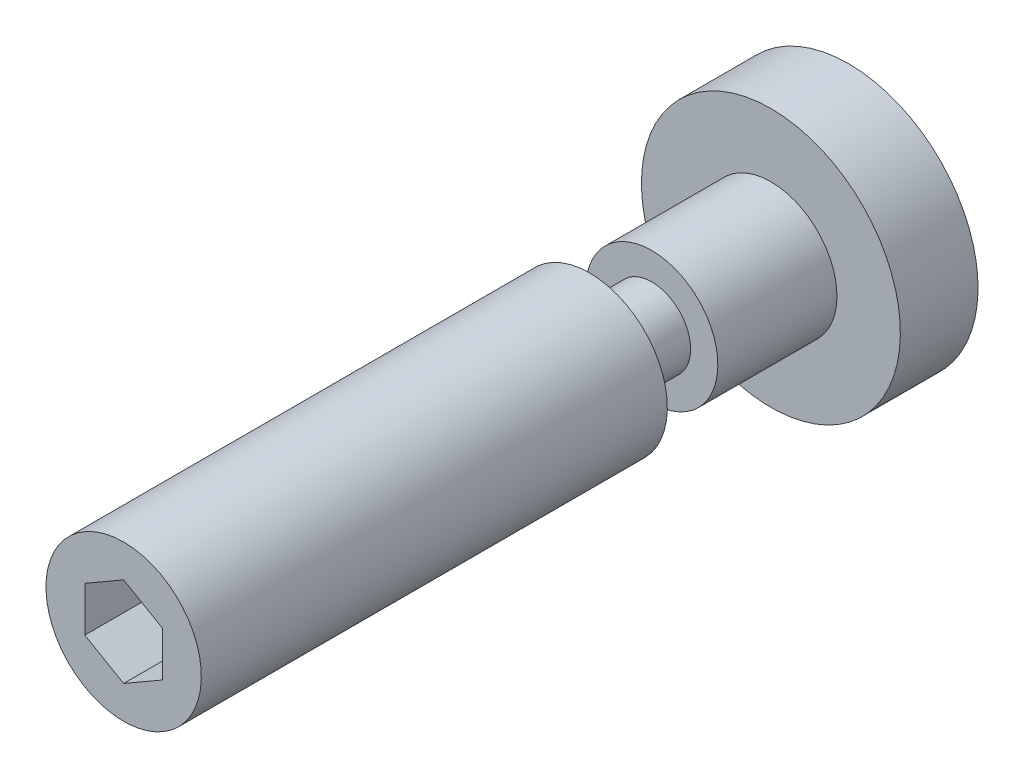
ISO-10303-21;
HEADER;
FILE_DESCRIPTION(('STEP AP214'),'2;1');
FILE_NAME('part.step','',(''),(''),'','','');
FILE_SCHEMA(('AUTOMOTIVE_DESIGN { 1 0 10303 214 1 1 1 1 }'));
ENDSEC;
DATA;
#1=APPLICATION_CONTEXT('core data for automotive mechanical design processes');
#2=APPLICATION_PROTOCOL_DEFINITION('international standard','automotive_design',2000,#1);
#3=PRODUCT_CONTEXT('',#1,'mechanical');
#4=PRODUCT('Part','Part','',(#3));
#5=PRODUCT_RELATED_PRODUCT_CATEGORY('part','',(#4));
#6=PRODUCT_DEFINITION_FORMATION('','',#4);
#7=PRODUCT_DEFINITION_CONTEXT('part definition',#1,'design');
#8=PRODUCT_DEFINITION('design','',#6,#7);
#9=PRODUCT_DEFINITION_SHAPE('','',#8);
#10=(LENGTH_UNIT() NAMED_UNIT(*) SI_UNIT(.MILLI.,.METRE.));
#11=(NAMED_UNIT(*) PLANE_ANGLE_UNIT() SI_UNIT($,.RADIAN.));
#12=(NAMED_UNIT(*) SI_UNIT($,.STERADIAN.) SOLID_ANGLE_UNIT());
#13=UNCERTAINTY_MEASURE_WITH_UNIT(LENGTH_MEASURE(1.E-05),#10,'distance_accuracy_value','');
#14=(GEOMETRIC_REPRESENTATION_CONTEXT(3) GLOBAL_UNCERTAINTY_ASSIGNED_CONTEXT((#13)) GLOBAL_UNIT_ASSIGNED_CONTEXT((#10,
#11,#12)) REPRESENTATION_CONTEXT('',''));
#15=CARTESIAN_POINT('',(0.,0.,0.));
#16=DIRECTION('',(0.,0.,1.));
#17=DIRECTION('',(1.,0.,0.));
#18=AXIS2_PLACEMENT_3D('',#15,#16,#17);
#19=CARTESIAN_POINT('',(0.,0.,0.));
#20=DIRECTION('',(0.,0.,1.));
#21=DIRECTION('',(0.,1.,0.));
#22=AXIS2_PLACEMENT_3D('',#19,#20,#21);
#23=PLANE('',#22);
#24=CARTESIAN_POINT('',(0.,0.,0.));
#25=DIRECTION('',(0.,0.,1.));
#26=DIRECTION('',(0.,1.,0.));
#27=AXIS2_PLACEMENT_3D('',#24,#25,#26);
#28=CIRCLE('',#27,5.);
#29=CARTESIAN_POINT('',(0.,5.,0.));
#30=VERTEX_POINT('',#29);
#31=EDGE_CURVE('E9',#30,#30,#28,.T.);
#32=ORIENTED_EDGE('',*,*,#31,.F.);
#33=EDGE_LOOP('',(#32));
#34=FACE_BOUND('',#33,.T.);
#35=ADVANCED_FACE('F14',(#34),#23,.F.);
#36=CARTESIAN_POINT('',(0.,0.,40.));
#37=DIRECTION('',(0.,0.,1.));
#38=DIRECTION('',(0.,1.,0.));
#39=AXIS2_PLACEMENT_3D('',#36,#37,#38);
#40=CYLINDRICAL_SURFACE('',#39,5.);
#41=CARTESIAN_POINT('',(0.,0.,3.));
#42=DIRECTION('',(0.,0.,1.));
#43=DIRECTION('',(0.,1.,0.));
#44=AXIS2_PLACEMENT_3D('',#41,#42,#43);
#45=CIRCLE('',#44,5.);
#46=CARTESIAN_POINT('',(0.,5.,3.));
#47=VERTEX_POINT('',#46);
#48=EDGE_CURVE('E21',#47,#47,#45,.T.);
#49=ORIENTED_EDGE('',*,*,#48,.F.);
#50=EDGE_LOOP('',(#49));
#51=FACE_BOUND('',#50,.T.);
#52=ORIENTED_EDGE('',*,*,#31,.T.);
#53=EDGE_LOOP('',(#52));
#54=FACE_BOUND('',#53,.T.);
#55=ADVANCED_FACE('F142',(#51,#54),#40,.T.);
#56=CARTESIAN_POINT('',(0.,-5.,3.));
#57=DIRECTION('',(0.,0.,-1.));
#58=DIRECTION('',(0.,-1.,0.));
#59=AXIS2_PLACEMENT_3D('',#56,#57,#58);
#60=PLANE('',#59);
#61=CARTESIAN_POINT('',(0.,0.,3.));
#62=DIRECTION('',(0.,0.,1.));
#63=DIRECTION('',(0.,1.,0.));
#64=AXIS2_PLACEMENT_3D('',#61,#62,#63);
#65=CIRCLE('',#64,2.55);
#66=CARTESIAN_POINT('',(0.,2.55,3.));
#67=VERTEX_POINT('',#66);
#68=EDGE_CURVE('E135',#67,#67,#65,.T.);
#69=ORIENTED_EDGE('',*,*,#68,.F.);
#70=EDGE_LOOP('',(#69));
#71=FACE_BOUND('',#70,.T.);
#72=ORIENTED_EDGE('',*,*,#48,.T.);
#73=EDGE_LOOP('',(#72));
#74=FACE_BOUND('',#73,.T.);
#75=ADVANCED_FACE('F140',(#71,#74),#60,.F.);
#76=CARTESIAN_POINT('',(0.,0.,40.));
#77=DIRECTION('',(0.,0.,1.));
#78=DIRECTION('',(0.,1.,0.));
#79=AXIS2_PLACEMENT_3D('',#76,#77,#78);
#80=CYLINDRICAL_SURFACE('',#79,2.55);
#81=CARTESIAN_POINT('',(0.,0.,7.6));
#82=DIRECTION('',(0.,0.,1.));
#83=DIRECTION('',(0.,1.,0.));
#84=AXIS2_PLACEMENT_3D('',#81,#82,#83);
#85=CIRCLE('',#84,2.55);
#86=CARTESIAN_POINT('',(0.,2.55,7.6));
#87=VERTEX_POINT('',#86);
#88=EDGE_CURVE('E132',#87,#87,#85,.T.);
#89=ORIENTED_EDGE('',*,*,#88,.F.);
#90=EDGE_LOOP('',(#89));
#91=FACE_BOUND('',#90,.T.);
#92=ORIENTED_EDGE('',*,*,#68,.T.);
#93=EDGE_LOOP('',(#92));
#94=FACE_BOUND('',#93,.T.);
#95=ADVANCED_FACE('F165',(#91,#94),#80,.T.);
#96=CARTESIAN_POINT('',(0.,-2.55,7.6));
#97=DIRECTION('',(0.,0.,-1.));
#98=DIRECTION('',(0.,-1.,0.));
#99=AXIS2_PLACEMENT_3D('',#96,#97,#98);
#100=PLANE('',#99);
#101=CARTESIAN_POINT('',(0.,0.,7.6));
#102=DIRECTION('',(0.,0.,1.));
#103=DIRECTION('',(0.,1.,0.));
#104=AXIS2_PLACEMENT_3D('',#101,#102,#103);
#105=CIRCLE('',#104,1.5);
#106=CARTESIAN_POINT('',(0.,1.5,7.6));
#107=VERTEX_POINT('',#106);
#108=EDGE_CURVE('E129',#107,#107,#105,.T.);
#109=ORIENTED_EDGE('',*,*,#108,.F.);
#110=EDGE_LOOP('',(#109));
#111=FACE_BOUND('',#110,.T.);
#112=ORIENTED_EDGE('',*,*,#88,.T.);
#113=EDGE_LOOP('',(#112));
#114=FACE_BOUND('',#113,.T.);
#115=ADVANCED_FACE('F174',(#111,#114),#100,.F.);
#116=CARTESIAN_POINT('',(0.,0.,40.));
#117=DIRECTION('',(0.,0.,1.));
#118=DIRECTION('',(0.,1.,0.));
#119=AXIS2_PLACEMENT_3D('',#116,#117,#118);
#120=CYLINDRICAL_SURFACE('',#119,1.5);
#121=CARTESIAN_POINT('',(0.,0.,10.));
#122=DIRECTION('',(0.,0.,1.));
#123=DIRECTION('',(0.,1.,0.));
#124=AXIS2_PLACEMENT_3D('',#121,#122,#123);
#125=CIRCLE('',#124,1.5);
#126=CARTESIAN_POINT('',(0.,1.5,10.));
#127=VERTEX_POINT('',#126);
#128=EDGE_CURVE('E126',#127,#127,#125,.T.);
#129=ORIENTED_EDGE('',*,*,#128,.F.);
#130=EDGE_LOOP('',(#129));
#131=FACE_BOUND('',#130,.T.);
#132=ORIENTED_EDGE('',*,*,#108,.T.);
#133=EDGE_LOOP('',(#132));
#134=FACE_BOUND('',#133,.T.);
#135=ADVANCED_FACE('F183',(#131,#134),#120,.T.);
#136=CARTESIAN_POINT('',(0.,-1.5,10.));
#137=DIRECTION('',(0.,0.,1.));
#138=DIRECTION('',(0.,1.,0.));
#139=AXIS2_PLACEMENT_3D('',#136,#137,#138);
#140=PLANE('',#139);
#141=CARTESIAN_POINT('',(0.,0.,10.));
#142=DIRECTION('',(0.,0.,1.));
#143=DIRECTION('',(0.,1.,0.));
#144=AXIS2_PLACEMENT_3D('',#141,#142,#143);
#145=CIRCLE('',#144,3.);
#146=CARTESIAN_POINT('',(0.,3.,10.));
#147=VERTEX_POINT('',#146);
#148=EDGE_CURVE('E123',#147,#147,#145,.T.);
#149=ORIENTED_EDGE('',*,*,#148,.F.);
#150=EDGE_LOOP('',(#149));
#151=FACE_BOUND('',#150,.T.);
#152=ORIENTED_EDGE('',*,*,#128,.T.);
#153=EDGE_LOOP('',(#152));
#154=FACE_BOUND('',#153,.T.);
#155=ADVANCED_FACE('F192',(#151,#154),#140,.F.);
#156=CARTESIAN_POINT('',(0.,0.,40.));
#157=DIRECTION('',(0.,0.,1.));
#158=DIRECTION('',(0.,1.,0.));
#159=AXIS2_PLACEMENT_3D('',#156,#157,#158);
#160=CYLINDRICAL_SURFACE('',#159,3.);
#161=CARTESIAN_POINT('',(0.,0.,28.));
#162=DIRECTION('',(0.,0.,1.));
#163=DIRECTION('',(0.,1.,0.));
#164=AXIS2_PLACEMENT_3D('',#161,#162,#163);
#165=CIRCLE('',#164,3.);
#166=CARTESIAN_POINT('',(0.,3.,28.));
#167=VERTEX_POINT('',#166);
#168=EDGE_CURVE('E115',#167,#167,#165,.T.);
#169=ORIENTED_EDGE('',*,*,#168,.F.);
#170=EDGE_LOOP('',(#169));
#171=FACE_BOUND('',#170,.T.);
#172=ORIENTED_EDGE('',*,*,#148,.T.);
#173=EDGE_LOOP('',(#172));
#174=FACE_BOUND('',#173,.T.);
#175=ADVANCED_FACE('F201',(#171,#174),#160,.T.);
#176=CARTESIAN_POINT('',(0.,-3.,28.));
#177=DIRECTION('',(0.,0.,-1.));
#178=DIRECTION('',(0.,-1.,0.));
#179=AXIS2_PLACEMENT_3D('',#176,#177,#178);
#180=PLANE('',#179);
#181=DIRECTION('',(-0.866025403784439,-0.5,0.));
#182=VECTOR('',#181,1.);
#183=CARTESIAN_POINT('',(0.,1.73205080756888,28.));
#184=LINE('',#183,#182);
#185=CARTESIAN_POINT('',(0.,1.73205080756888,28.));
#186=VERTEX_POINT('',#185);
#187=CARTESIAN_POINT('',(-1.5,0.866025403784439,28.));
#188=VERTEX_POINT('',#187);
#189=EDGE_CURVE('E102',#186,#188,#184,.T.);
#190=ORIENTED_EDGE('',*,*,#189,.F.);
#191=DIRECTION('',(-0.866025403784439,0.5,0.));
#192=VECTOR('',#191,1.);
#193=CARTESIAN_POINT('',(1.5,0.866025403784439,28.));
#194=LINE('',#193,#192);
#195=CARTESIAN_POINT('',(1.5,0.866025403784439,28.));
#196=VERTEX_POINT('',#195);
#197=EDGE_CURVE('E28',#196,#186,#194,.T.);
#198=ORIENTED_EDGE('',*,*,#197,.F.);
#199=DIRECTION('',(0.,1.,0.));
#200=VECTOR('',#199,1.);
#201=CARTESIAN_POINT('',(1.5,-0.866025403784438,28.));
#202=LINE('',#201,#200);
#203=CARTESIAN_POINT('',(1.5,-0.866025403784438,28.));
#204=VERTEX_POINT('',#203);
#205=EDGE_CURVE('E111',#204,#196,#202,.T.);
#206=ORIENTED_EDGE('',*,*,#205,.F.);
#207=DIRECTION('',(0.866025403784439,0.5,0.));
#208=VECTOR('',#207,1.);
#209=CARTESIAN_POINT('',(0.,-1.73205080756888,28.));
#210=LINE('',#209,#208);
#211=CARTESIAN_POINT('',(0.,-1.73205080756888,28.));
#212=VERTEX_POINT('',#211);
#213=EDGE_CURVE('E109',#212,#204,#210,.T.);
#214=ORIENTED_EDGE('',*,*,#213,.F.);
#215=DIRECTION('',(0.866025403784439,-0.5,0.));
#216=VECTOR('',#215,1.);
#217=CARTESIAN_POINT('',(-1.5,-0.866025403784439,28.));
#218=LINE('',#217,#216);
#219=CARTESIAN_POINT('',(-1.5,-0.866025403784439,28.));
#220=VERTEX_POINT('',#219);
#221=EDGE_CURVE('E76',#220,#212,#218,.T.);
#222=ORIENTED_EDGE('',*,*,#221,.F.);
#223=DIRECTION('',(0.,-1.,0.));
#224=VECTOR('',#223,1.);
#225=CARTESIAN_POINT('',(-1.5,0.866025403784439,28.));
#226=LINE('',#225,#224);
#227=EDGE_CURVE('E105',#188,#220,#226,.T.);
#228=ORIENTED_EDGE('',*,*,#227,.F.);
#229=EDGE_LOOP('',(#190,#198,#206,#214,#222,#228));
#230=FACE_BOUND('',#229,.T.);
#231=ORIENTED_EDGE('',*,*,#168,.T.);
#232=EDGE_LOOP('',(#231));
#233=FACE_BOUND('',#232,.T.);
#234=ADVANCED_FACE('F210',(#230,#233),#180,.F.);
#235=CARTESIAN_POINT('',(1.5,0.866025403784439,24.));
#236=DIRECTION('',(0.5,0.866025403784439,0.));
#237=DIRECTION('',(-0.866025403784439,0.5,0.));
#238=AXIS2_PLACEMENT_3D('',#235,#236,#237);
#239=PLANE('',#238);
#240=ORIENTED_EDGE('',*,*,#197,.T.);
#241=DIRECTION('',(0.,0.,1.));
#242=VECTOR('',#241,1.);
#243=CARTESIAN_POINT('',(0.,1.73205080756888,24.));
#244=LINE('',#243,#242);
#245=CARTESIAN_POINT('',(0.,1.73205080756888,24.));
#246=VERTEX_POINT('',#245);
#247=EDGE_CURVE('E58',#246,#186,#244,.T.);
#248=ORIENTED_EDGE('',*,*,#247,.F.);
#249=DIRECTION('',(-0.866025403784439,0.5,0.));
#250=VECTOR('',#249,1.);
#251=CARTESIAN_POINT('',(1.5,0.866025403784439,24.));
#252=LINE('',#251,#250);
#253=CARTESIAN_POINT('',(1.5,0.866025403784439,24.));
#254=VERTEX_POINT('',#253);
#255=EDGE_CURVE('E113',#254,#246,#252,.T.);
#256=ORIENTED_EDGE('',*,*,#255,.F.);
#257=DIRECTION('',(0.,0.,1.));
#258=VECTOR('',#257,1.);
#259=CARTESIAN_POINT('',(1.5,0.866025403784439,24.));
#260=LINE('',#259,#258);
#261=EDGE_CURVE('E36',#254,#196,#260,.T.);
#262=ORIENTED_EDGE('',*,*,#261,.T.);
#263=EDGE_LOOP('',(#240,#248,#256,#262));
#264=FACE_BOUND('',#263,.T.);
#265=ADVANCED_FACE('F219',(#264),#239,.F.);
#266=CARTESIAN_POINT('',(1.5,-0.866025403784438,24.));
#267=DIRECTION('',(1.,0.,0.));
#268=DIRECTION('',(0.,0.,-1.));
#269=AXIS2_PLACEMENT_3D('',#266,#267,#268);
#270=PLANE('',#269);
#271=ORIENTED_EDGE('',*,*,#205,.T.);
#272=ORIENTED_EDGE('',*,*,#261,.F.);
#273=DIRECTION('',(0.,1.,0.));
#274=VECTOR('',#273,1.);
#275=CARTESIAN_POINT('',(1.5,-0.866025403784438,24.));
#276=LINE('',#275,#274);
#277=CARTESIAN_POINT('',(1.5,-0.866025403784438,24.));
#278=VERTEX_POINT('',#277);
#279=EDGE_CURVE('E88',#278,#254,#276,.T.);
#280=ORIENTED_EDGE('',*,*,#279,.F.);
#281=DIRECTION('',(0.,0.,1.));
#282=VECTOR('',#281,1.);
#283=CARTESIAN_POINT('',(1.5,-0.866025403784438,24.));
#284=LINE('',#283,#282);
#285=EDGE_CURVE('E80',#278,#204,#284,.T.);
#286=ORIENTED_EDGE('',*,*,#285,.T.);
#287=EDGE_LOOP('',(#271,#272,#280,#286));
#288=FACE_BOUND('',#287,.T.);
#289=ADVANCED_FACE('F228',(#288),#270,.F.);
#290=CARTESIAN_POINT('',(0.,-1.73205080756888,24.));
#291=DIRECTION('',(0.5,-0.866025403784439,0.));
#292=DIRECTION('',(0.866025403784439,0.5,0.));
#293=AXIS2_PLACEMENT_3D('',#290,#291,#292);
#294=PLANE('',#293);
#295=ORIENTED_EDGE('',*,*,#213,.T.);
#296=ORIENTED_EDGE('',*,*,#285,.F.);
#297=DIRECTION('',(0.866025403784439,0.5,0.));
#298=VECTOR('',#297,1.);
#299=CARTESIAN_POINT('',(0.,-1.73205080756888,24.));
#300=LINE('',#299,#298);
#301=CARTESIAN_POINT('',(0.,-1.73205080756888,24.));
#302=VERTEX_POINT('',#301);
#303=EDGE_CURVE('E84',#302,#278,#300,.T.);
#304=ORIENTED_EDGE('',*,*,#303,.F.);
#305=DIRECTION('',(0.,0.,1.));
#306=VECTOR('',#305,1.);
#307=CARTESIAN_POINT('',(0.,-1.73205080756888,24.));
#308=LINE('',#307,#306);
#309=EDGE_CURVE('E69',#302,#212,#308,.T.);
#310=ORIENTED_EDGE('',*,*,#309,.T.);
#311=EDGE_LOOP('',(#295,#296,#304,#310));
#312=FACE_BOUND('',#311,.T.);
#313=ADVANCED_FACE('F85',(#312),#294,.F.);
#314=CARTESIAN_POINT('',(-1.5,-0.866025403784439,24.));
#315=DIRECTION('',(-0.5,-0.866025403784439,0.));
#316=DIRECTION('',(0.866025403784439,-0.5,0.));
#317=AXIS2_PLACEMENT_3D('',#314,#315,#316);
#318=PLANE('',#317);
#319=ORIENTED_EDGE('',*,*,#221,.T.);
#320=ORIENTED_EDGE('',*,*,#309,.F.);
#321=DIRECTION('',(0.866025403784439,-0.5,0.));
#322=VECTOR('',#321,1.);
#323=CARTESIAN_POINT('',(-1.5,-0.866025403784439,24.));
#324=LINE('',#323,#322);
#325=CARTESIAN_POINT('',(-1.5,-0.866025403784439,24.));
#326=VERTEX_POINT('',#325);
#327=EDGE_CURVE('E73',#326,#302,#324,.T.);
#328=ORIENTED_EDGE('',*,*,#327,.F.);
#329=DIRECTION('',(0.,0.,1.));
#330=VECTOR('',#329,1.);
#331=CARTESIAN_POINT('',(-1.5,-0.866025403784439,24.));
#332=LINE('',#331,#330);
#333=EDGE_CURVE('E81',#326,#220,#332,.T.);
#334=ORIENTED_EDGE('',*,*,#333,.T.);
#335=EDGE_LOOP('',(#319,#320,#328,#334));
#336=FACE_BOUND('',#335,.T.);
#337=ADVANCED_FACE('F71',(#336),#318,.F.);
#338=CARTESIAN_POINT('',(-1.5,0.866025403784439,24.));
#339=DIRECTION('',(-1.,0.,0.));
#340=DIRECTION('',(0.,-1.,0.));
#341=AXIS2_PLACEMENT_3D('',#338,#339,#340);
#342=PLANE('',#341);
#343=ORIENTED_EDGE('',*,*,#227,.T.);
#344=ORIENTED_EDGE('',*,*,#333,.F.);
#345=DIRECTION('',(0.,-1.,0.));
#346=VECTOR('',#345,1.);
#347=CARTESIAN_POINT('',(-1.5,0.866025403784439,24.));
#348=LINE('',#347,#346);
#349=CARTESIAN_POINT('',(-1.5,0.866025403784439,24.));
#350=VERTEX_POINT('',#349);
#351=EDGE_CURVE('E94',#350,#326,#348,.T.);
#352=ORIENTED_EDGE('',*,*,#351,.F.);
#353=DIRECTION('',(0.,0.,1.));
#354=VECTOR('',#353,1.);
#355=CARTESIAN_POINT('',(-1.5,0.866025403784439,24.));
#356=LINE('',#355,#354);
#357=EDGE_CURVE('E118',#350,#188,#356,.T.);
#358=ORIENTED_EDGE('',*,*,#357,.T.);
#359=EDGE_LOOP('',(#343,#344,#352,#358));
#360=FACE_BOUND('',#359,.T.);
#361=ADVANCED_FACE('F250',(#360),#342,.F.);
#362=CARTESIAN_POINT('',(0.,1.73205080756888,24.));
#363=DIRECTION('',(-0.5,0.866025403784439,0.));
#364=DIRECTION('',(-0.866025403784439,-0.5,0.));
#365=AXIS2_PLACEMENT_3D('',#362,#363,#364);
#366=PLANE('',#365);
#367=ORIENTED_EDGE('',*,*,#189,.T.);
#368=ORIENTED_EDGE('',*,*,#357,.F.);
#369=DIRECTION('',(-0.866025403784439,-0.5,0.));
#370=VECTOR('',#369,1.);
#371=CARTESIAN_POINT('',(0.,1.73205080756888,24.));
#372=LINE('',#371,#370);
#373=EDGE_CURVE('E96',#246,#350,#372,.T.);
#374=ORIENTED_EDGE('',*,*,#373,.F.);
#375=ORIENTED_EDGE('',*,*,#247,.T.);
#376=EDGE_LOOP('',(#367,#368,#374,#375));
#377=FACE_BOUND('',#376,.T.);
#378=ADVANCED_FACE('F258',(#377),#366,.F.);
#379=CARTESIAN_POINT('',(0.,1.73205080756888,24.));
#380=DIRECTION('',(0.,0.,1.));
#381=DIRECTION('',(1.,0.,0.));
#382=AXIS2_PLACEMENT_3D('',#379,#380,#381);
#383=PLANE('',#382);
#384=ORIENTED_EDGE('',*,*,#255,.T.);
#385=ORIENTED_EDGE('',*,*,#373,.T.);
#386=ORIENTED_EDGE('',*,*,#351,.T.);
#387=ORIENTED_EDGE('',*,*,#327,.T.);
#388=ORIENTED_EDGE('',*,*,#303,.T.);
#389=ORIENTED_EDGE('',*,*,#279,.T.);
#390=EDGE_LOOP('',(#384,#385,#386,#387,#388,#389));
#391=FACE_BOUND('',#390,.T.);
#392=ADVANCED_FACE('F91',(#391),#383,.T.);
#393=CLOSED_SHELL('',(#35,#55,#75,#95,#115,#135,#155,#175,#234,#265,#289,#313,#337,#361,#378,#392));
#394=MANIFOLD_SOLID_BREP('B1',#393);
#395=ADVANCED_BREP_SHAPE_REPRESENTATION('',(#18,#394),#14);
#396=SHAPE_DEFINITION_REPRESENTATION(#9,#395);
ENDSEC;
END-ISO-10303-21;
